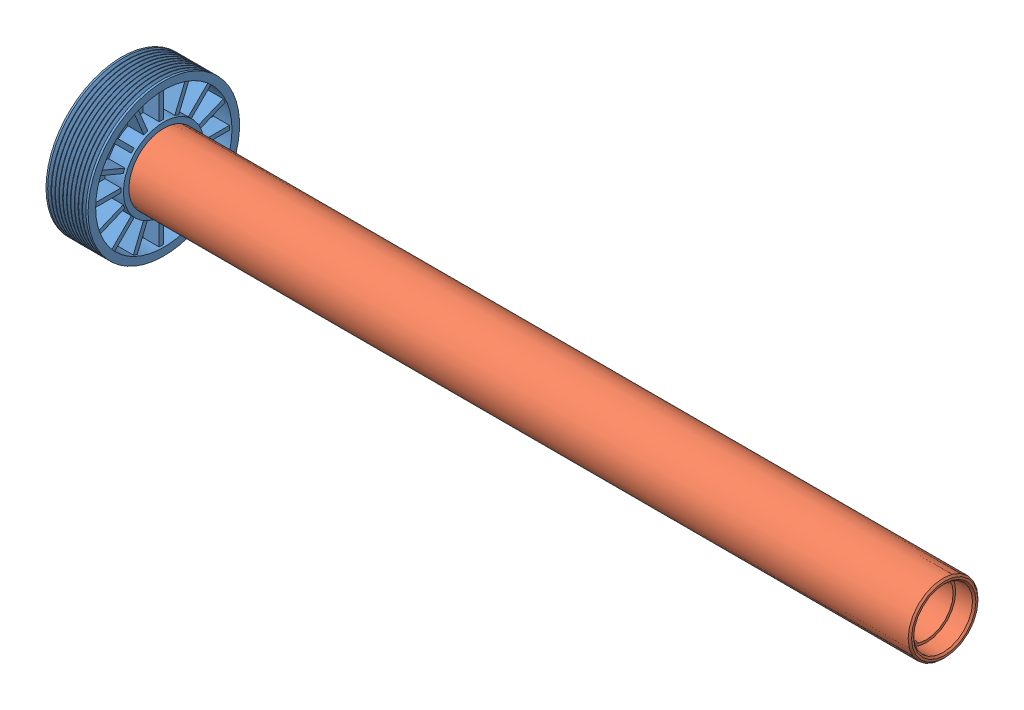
SolidWorks assembly Rouleau avant.SLDASM, configuration Défaut (file format 14000). Lengths in mm.
Overall size (500 90 90).
3 component instances, 3 part files, 4 mates.
Components (placement in the parent):
- Poulie réceptrice-1: Poulie réceptrice.SLDPRT [Défaut] at (-28.2021 31.7371 0) size (25 90 90)
- Rouleau avant-1: Rouleau avant.SLDPRT [Défaut] at (448.2979 10.9871 0) x (0 0 1) z (-1 0 0) size (41.5 41.5 500)
- aimant-1: aimant.SLDPRT [Défaut] at (-29.7021 36.7965 -25.8094) x (0 0 1) z (-1 0 0) size (14 14 9)
Mates (geometry in assembly coordinates):
- Coaxiale1: concentric anti-aligned: cylinder of Poulie réceptrice-1 through (-58.3653 10.9871 0) axis (-1 0 0) radius 20.75; cylinder of Rouleau avant-1 through (198.2979 10.9871 0) axis (1 0 0) radius 20.75
- Distance1: distance = 11 mm aligned: plane of Poulie réceptrice-1 through (-40.7021 31.7371 0) normal (-1 0 0); plane of Rouleau avant-1 through (-51.7021 10.9871 0) normal (-1 0 0)
- Coaxiale2: concentric anti-aligned: cylinder of Poulie réceptrice-1 through (-5.6605 36.7965 -25.8094) axis (-1 0 0) radius 7; cylinder of aimant-1 through (-38.7021 36.7965 -25.8094) axis (1 0 0) radius 7
- Coïncidente2: coincident anti-aligned: plane of Poulie réceptrice-1 through (-29.7021 34.9871 0) normal (-1 0 0); plane of aimant-1 through (-29.7021 36.7965 -25.8094) normal (1 0 0)
